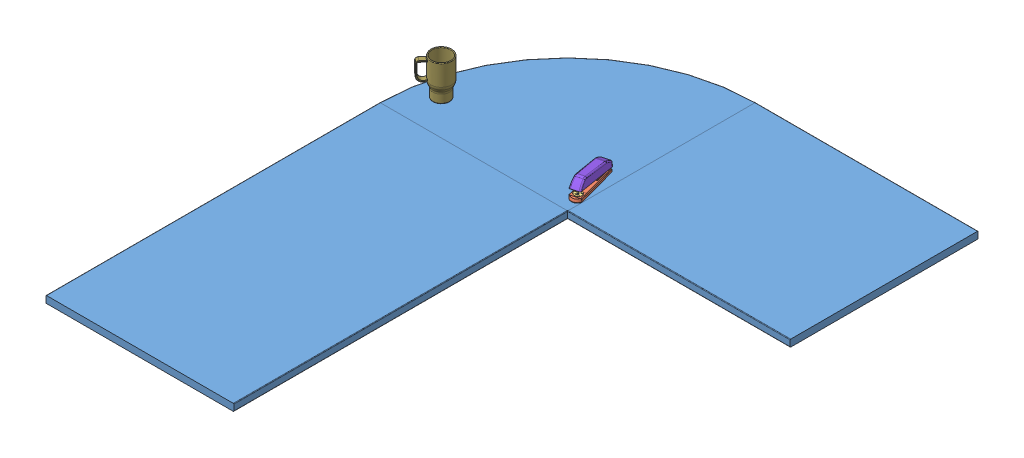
SolidWorks assembly PhotoWorks Office.SLDASM, configuration Default (file format 3100). Lengths in mm.
Overall size (1498.6 160.02 1905).
13 component instances, 12 part files, 4 mates.
Components (placement in the parent):
- Desk-1: Desk.SLDPRT [Default] at (-770.1139 -738.1247 955.8909) size (1498.6 25.4 1905)
- Stapler-1: Stapler.SLDASM [Default] at (-144.0042 23.8753 -461.107) x (0.964483 0 -0.264146) z (0.264146 0 0.964483) size (41.3 66.48 177.35)
  - Stapler Base-1: Stapler Base.SLDPRT [Default] at origin size (40.21 32.13 169.75)
  - Staple Plate-1: Staple Plate.SLDPRT [Default] at (0 12.192 142.748) size (27.94 3.13 27.94)
  - Staple Holder bottom-1: Staple Holder bottom.SLDPRT [Default] at (-0.127 18.5683 7.868) x (1 0 0) z (0 0.031657 0.999499) size (15.49 16.26 146.43)
  - Staple Holder Top-3: Staple Holder Top.SLDPRT [Default] at (-0.1143 33.9276 7.3815) x (1 0 0) z (0 0.031657 0.999499) size (12.83 13.72 146.94)
  - Stapler Hinge Bushing-1: Stapler Hinge Bushing.SLDPRT [Default] at (-0.1016 25.2959 7.6549) x (1 0 0) z (0 0.828849 0.559472) size (10.16 10.87 10.87)
  - Stapler Hinge Pin-1: Stapler Hinge Pin.SLDPRT [Default] at (-0.127 25.2959 7.6549) x (0 1 0) z (0 0 1) size (5.08 36.83 5.08)
  - Stapler Top Cover-1: Stapler Top Cover.SLDPRT [Default] at (-0.127 16.3133 -4.4424) x (1 0 0) z (0 0.111667 0.993746) size (41.3 31.82 166.53)
  - Stapler Eject Bracket-1: Stapler Eject Bracket.SLDPRT [Default] at (-0.127 46.6102 124.1493) x (1 0 0) z (0 -0.111667 -0.993746) size (12.83 21.59 22.86)
  - plate holder-1: plate holder.SLDPRT [Default] at (0 13.208 142.748) x (0.542732 0 -0.839906) z (0.839906 0 0.542732) size (6.35 10.92 6.35)
  - Staple Guide-1: Staple Guide.SLDPRT [Default] at (-0.127 29.8131 146.2654) x (-1 0 0) z (0 -0.031657 -0.999499) size (10.41 5.59 132.84)
- Coffee Mug-1: Coffee Mug.SLDPRT [Default] at (-674.1175 23.8753 -391.7018) x (0.65421 0 -0.756313) z (0.756313 0 0.65421) size (106.66 134.62 76.2)
Mates (geometry in assembly coordinates):
- Coincident1: coincident anti-aligned: plane of Desk-1 through (-84.3139 23.8753 -263.3091) normal (0 1 0); plane of Stapler-1/Stapler Base-1 through (-129.2976 23.8753 -332.4045) normal (0 -1 0)
- Coincident4: coincident anti-aligned: plane of Desk-1 through (-84.3139 23.8753 -263.3091) normal (0 1 0); plane of Coffee Mug-1 through (-648.2663 23.8753 -348.9369) normal (0 -1 0)
- PLANE1: unknown = 40.64 mm: unknown of Desk-1
- PLANE2: unknown = 78.74 mm: unknown of Desk-1
